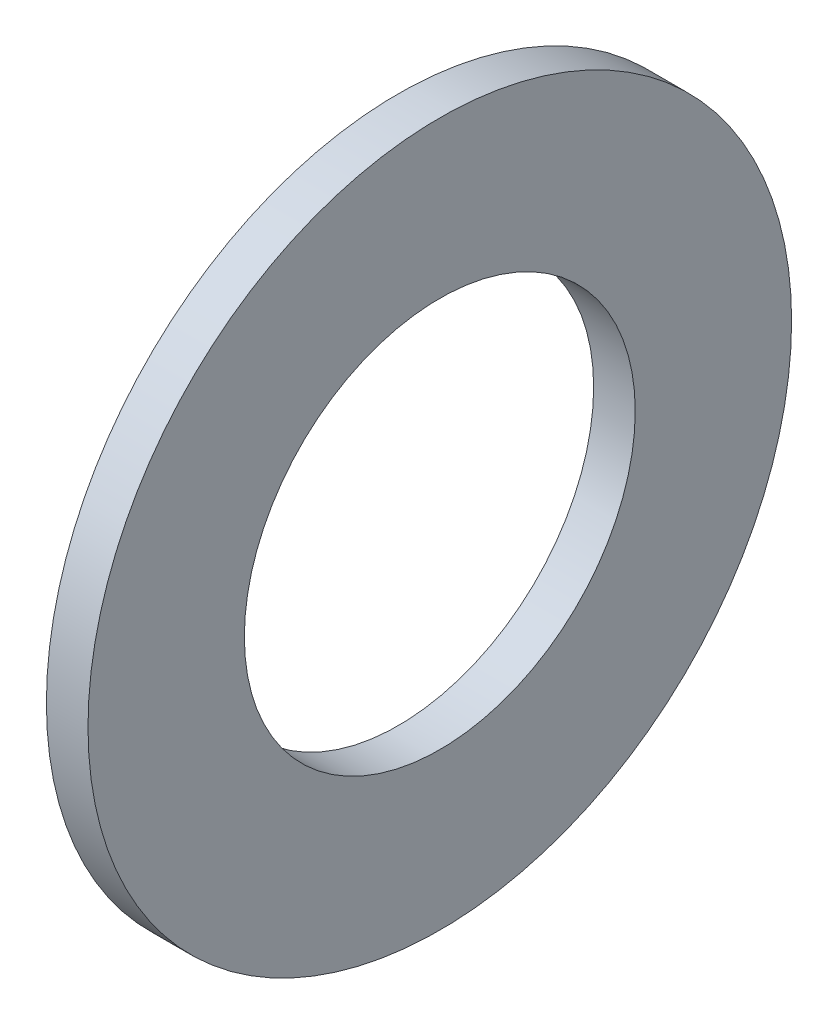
from build123d import *

# Parameters (mm, degrees)
ESQUISSE1_W = 2.66
ESQUISSE1_H = 10


with BuildPart() as part:
    # Esquisse1 → Base-R_volution (revolve)
    with BuildSketch(Plane(origin=(0, 0, 0), x_dir=(1, 0, 0), z_dir=(0, 1, 0)), mode=Mode.PRIVATE) as base_r_volution_sk:
        with Locations((1.33, 17.5)):
            Rectangle(ESQUISSE1_W, ESQUISSE1_H)
    revolve(base_r_volution_sk.sketch.rotate(Axis((0, 0, 0), (1, 0, 0)), 180), axis=Axis((0, 0, 0), (1, 0, 0)))


solid = part.part
